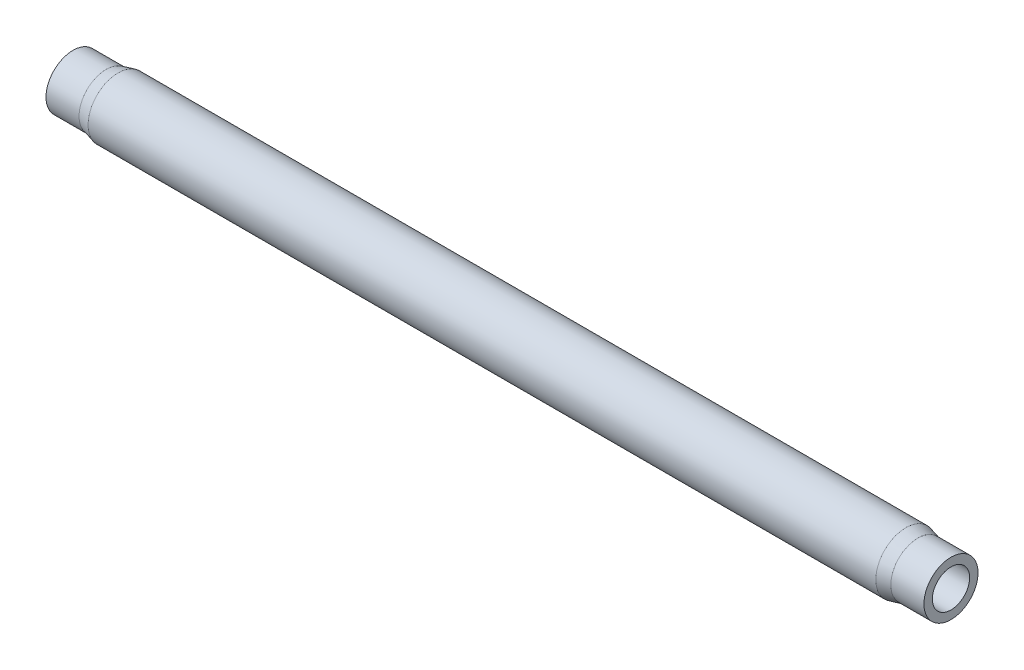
ISO-10303-21;
HEADER;
FILE_DESCRIPTION(('STEP AP214'),'2;1');
FILE_NAME('part.step','',(''),(''),'','','');
FILE_SCHEMA(('AUTOMOTIVE_DESIGN { 1 0 10303 214 1 1 1 1 }'));
ENDSEC;
DATA;
#1=APPLICATION_CONTEXT('core data for automotive mechanical design processes');
#2=APPLICATION_PROTOCOL_DEFINITION('international standard','automotive_design',2000,#1);
#3=PRODUCT_CONTEXT('',#1,'mechanical');
#4=PRODUCT('Part','Part','',(#3));
#5=PRODUCT_RELATED_PRODUCT_CATEGORY('part','',(#4));
#6=PRODUCT_DEFINITION_FORMATION('','',#4);
#7=PRODUCT_DEFINITION_CONTEXT('part definition',#1,'design');
#8=PRODUCT_DEFINITION('design','',#6,#7);
#9=PRODUCT_DEFINITION_SHAPE('','',#8);
#10=(LENGTH_UNIT() NAMED_UNIT(*) SI_UNIT(.MILLI.,.METRE.));
#11=(NAMED_UNIT(*) PLANE_ANGLE_UNIT() SI_UNIT($,.RADIAN.));
#12=(NAMED_UNIT(*) SI_UNIT($,.STERADIAN.) SOLID_ANGLE_UNIT());
#13=UNCERTAINTY_MEASURE_WITH_UNIT(LENGTH_MEASURE(1.E-05),#10,'distance_accuracy_value','');
#14=(GEOMETRIC_REPRESENTATION_CONTEXT(3) GLOBAL_UNCERTAINTY_ASSIGNED_CONTEXT((#13)) GLOBAL_UNIT_ASSIGNED_CONTEXT((#10,
#11,#12)) REPRESENTATION_CONTEXT('',''));
#15=CARTESIAN_POINT('',(0.,0.,0.));
#16=DIRECTION('',(0.,0.,1.));
#17=DIRECTION('',(1.,0.,0.));
#18=AXIS2_PLACEMENT_3D('',#15,#16,#17);
#19=CARTESIAN_POINT('',(-10.,0.,0.));
#20=DIRECTION('',(-1.,0.,0.));
#21=DIRECTION('',(0.,0.,1.));
#22=AXIS2_PLACEMENT_3D('',#19,#20,#21);
#23=CYLINDRICAL_SURFACE('',#22,3.09999999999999);
#24=CARTESIAN_POINT('',(146.,0.,0.));
#25=DIRECTION('',(-1.,0.,0.));
#26=DIRECTION('',(0.,0.,1.));
#27=AXIS2_PLACEMENT_3D('',#24,#25,#26);
#28=CIRCLE('',#27,3.1);
#29=CARTESIAN_POINT('',(146.,0.,3.1));
#30=VERTEX_POINT('',#29);
#31=EDGE_CURVE('E56',#30,#30,#28,.T.);
#32=ORIENTED_EDGE('',*,*,#31,.F.);
#33=EDGE_LOOP('',(#32));
#34=FACE_BOUND('',#33,.T.);
#35=CARTESIAN_POINT('',(0.,0.,0.));
#36=DIRECTION('',(-1.,0.,0.));
#37=DIRECTION('',(0.,0.,1.));
#38=AXIS2_PLACEMENT_3D('',#35,#36,#37);
#39=CIRCLE('',#38,3.09999999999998);
#40=CARTESIAN_POINT('',(0.,0.,3.09999999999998));
#41=VERTEX_POINT('',#40);
#42=EDGE_CURVE('E10',#41,#41,#39,.T.);
#43=ORIENTED_EDGE('',*,*,#42,.T.);
#44=EDGE_LOOP('',(#43));
#45=FACE_BOUND('',#44,.T.);
#46=ADVANCED_FACE('F28',(#34,#45),#23,.F.);
#47=CARTESIAN_POINT('',(0.,3.09999999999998,0.));
#48=DIRECTION('',(1.,0.,0.));
#49=DIRECTION('',(0.,0.,-1.));
#50=AXIS2_PLACEMENT_3D('',#47,#48,#49);
#51=PLANE('',#50);
#52=ORIENTED_EDGE('',*,*,#42,.F.);
#53=EDGE_LOOP('',(#52));
#54=FACE_BOUND('',#53,.T.);
#55=CARTESIAN_POINT('',(0.,0.,0.));
#56=DIRECTION('',(-1.,0.,0.));
#57=DIRECTION('',(0.,0.,1.));
#58=AXIS2_PLACEMENT_3D('',#55,#56,#57);
#59=CIRCLE('',#58,4.5);
#60=CARTESIAN_POINT('',(0.,0.,4.5));
#61=VERTEX_POINT('',#60);
#62=EDGE_CURVE('E34',#61,#61,#59,.T.);
#63=ORIENTED_EDGE('',*,*,#62,.T.);
#64=EDGE_LOOP('',(#63));
#65=FACE_BOUND('',#64,.T.);
#66=ADVANCED_FACE('F63',(#54,#65),#51,.F.);
#67=CARTESIAN_POINT('',(-10.,0.,0.));
#68=DIRECTION('',(-1.,0.,0.));
#69=DIRECTION('',(0.,0.,1.));
#70=AXIS2_PLACEMENT_3D('',#67,#68,#69);
#71=CYLINDRICAL_SURFACE('',#70,4.5);
#72=ORIENTED_EDGE('',*,*,#62,.F.);
#73=EDGE_LOOP('',(#72));
#74=FACE_BOUND('',#73,.T.);
#75=CARTESIAN_POINT('',(5.5,0.,0.));
#76=DIRECTION('',(-1.,0.,0.));
#77=DIRECTION('',(0.,0.,1.));
#78=AXIS2_PLACEMENT_3D('',#75,#76,#77);
#79=CIRCLE('',#78,4.5);
#80=CARTESIAN_POINT('',(5.5,0.,4.5));
#81=VERTEX_POINT('',#80);
#82=EDGE_CURVE('E38',#81,#81,#79,.T.);
#83=ORIENTED_EDGE('',*,*,#82,.T.);
#84=EDGE_LOOP('',(#83));
#85=FACE_BOUND('',#84,.T.);
#86=ADVANCED_FACE('F67',(#74,#85),#71,.T.);
#87=CARTESIAN_POINT('',(7.5,0.,0.));
#88=DIRECTION('',(1.,0.,0.));
#89=DIRECTION('',(0.,0.,-1.));
#90=AXIS2_PLACEMENT_3D('',#87,#88,#89);
#91=CONICAL_SURFACE('',#90,4.99999999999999,0.244978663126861);
#92=ORIENTED_EDGE('',*,*,#82,.F.);
#93=EDGE_LOOP('',(#92));
#94=FACE_BOUND('',#93,.T.);
#95=CARTESIAN_POINT('',(7.5,0.,0.));
#96=DIRECTION('',(-1.,0.,0.));
#97=DIRECTION('',(0.,0.,1.));
#98=AXIS2_PLACEMENT_3D('',#95,#96,#97);
#99=CIRCLE('',#98,4.99999999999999);
#100=CARTESIAN_POINT('',(7.5,0.,4.99999999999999));
#101=VERTEX_POINT('',#100);
#102=EDGE_CURVE('E42',#101,#101,#99,.T.);
#103=ORIENTED_EDGE('',*,*,#102,.T.);
#104=EDGE_LOOP('',(#103));
#105=FACE_BOUND('',#104,.T.);
#106=ADVANCED_FACE('F72',(#94,#105),#91,.T.);
#107=CARTESIAN_POINT('',(-10.,0.,0.));
#108=DIRECTION('',(-1.,0.,0.));
#109=DIRECTION('',(0.,0.,1.));
#110=AXIS2_PLACEMENT_3D('',#107,#108,#109);
#111=CYLINDRICAL_SURFACE('',#110,5.);
#112=ORIENTED_EDGE('',*,*,#102,.F.);
#113=EDGE_LOOP('',(#112));
#114=FACE_BOUND('',#113,.T.);
#115=CARTESIAN_POINT('',(138.5,0.,0.));
#116=DIRECTION('',(-1.,0.,0.));
#117=DIRECTION('',(0.,0.,1.));
#118=AXIS2_PLACEMENT_3D('',#115,#116,#117);
#119=CIRCLE('',#118,5.);
#120=CARTESIAN_POINT('',(138.5,0.,5.));
#121=VERTEX_POINT('',#120);
#122=EDGE_CURVE('E47',#121,#121,#119,.T.);
#123=ORIENTED_EDGE('',*,*,#122,.T.);
#124=EDGE_LOOP('',(#123));
#125=FACE_BOUND('',#124,.T.);
#126=ADVANCED_FACE('F78',(#114,#125),#111,.T.);
#127=CARTESIAN_POINT('',(140.5,0.,0.));
#128=DIRECTION('',(-1.,0.,0.));
#129=DIRECTION('',(0.,0.,1.));
#130=AXIS2_PLACEMENT_3D('',#127,#128,#129);
#131=CONICAL_SURFACE('',#130,4.50000000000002,0.244978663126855);
#132=ORIENTED_EDGE('',*,*,#122,.F.);
#133=EDGE_LOOP('',(#132));
#134=FACE_BOUND('',#133,.T.);
#135=CARTESIAN_POINT('',(140.5,0.,0.));
#136=DIRECTION('',(-1.,0.,0.));
#137=DIRECTION('',(0.,0.,1.));
#138=AXIS2_PLACEMENT_3D('',#135,#136,#137);
#139=CIRCLE('',#138,4.50000000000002);
#140=CARTESIAN_POINT('',(140.5,0.,4.50000000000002));
#141=VERTEX_POINT('',#140);
#142=EDGE_CURVE('E50',#141,#141,#139,.T.);
#143=ORIENTED_EDGE('',*,*,#142,.T.);
#144=EDGE_LOOP('',(#143));
#145=FACE_BOUND('',#144,.T.);
#146=ADVANCED_FACE('F82',(#134,#145),#131,.T.);
#147=CARTESIAN_POINT('',(-10.,0.,0.));
#148=DIRECTION('',(-1.,0.,0.));
#149=DIRECTION('',(0.,0.,1.));
#150=AXIS2_PLACEMENT_3D('',#147,#148,#149);
#151=CYLINDRICAL_SURFACE('',#150,4.50000000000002);
#152=ORIENTED_EDGE('',*,*,#142,.F.);
#153=EDGE_LOOP('',(#152));
#154=FACE_BOUND('',#153,.T.);
#155=CARTESIAN_POINT('',(146.,0.,0.));
#156=DIRECTION('',(-1.,0.,0.));
#157=DIRECTION('',(0.,0.,1.));
#158=AXIS2_PLACEMENT_3D('',#155,#156,#157);
#159=CIRCLE('',#158,4.50000000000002);
#160=CARTESIAN_POINT('',(146.,0.,4.50000000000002));
#161=VERTEX_POINT('',#160);
#162=EDGE_CURVE('E53',#161,#161,#159,.T.);
#163=ORIENTED_EDGE('',*,*,#162,.T.);
#164=EDGE_LOOP('',(#163));
#165=FACE_BOUND('',#164,.T.);
#166=ADVANCED_FACE('F86',(#154,#165),#151,.T.);
#167=CARTESIAN_POINT('',(146.,4.50000000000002,0.));
#168=DIRECTION('',(-1.,0.,0.));
#169=DIRECTION('',(0.,0.,1.));
#170=AXIS2_PLACEMENT_3D('',#167,#168,#169);
#171=PLANE('',#170);
#172=ORIENTED_EDGE('',*,*,#162,.F.);
#173=EDGE_LOOP('',(#172));
#174=FACE_BOUND('',#173,.T.);
#175=ORIENTED_EDGE('',*,*,#31,.T.);
#176=EDGE_LOOP('',(#175));
#177=FACE_BOUND('',#176,.T.);
#178=ADVANCED_FACE('F60',(#174,#177),#171,.F.);
#179=CLOSED_SHELL('',(#46,#66,#86,#106,#126,#146,#166,#178));
#180=MANIFOLD_SOLID_BREP('B2',#179);
#181=ADVANCED_BREP_SHAPE_REPRESENTATION('',(#18,#180),#14);
#182=SHAPE_DEFINITION_REPRESENTATION(#9,#181);
ENDSEC;
END-ISO-10303-21;
